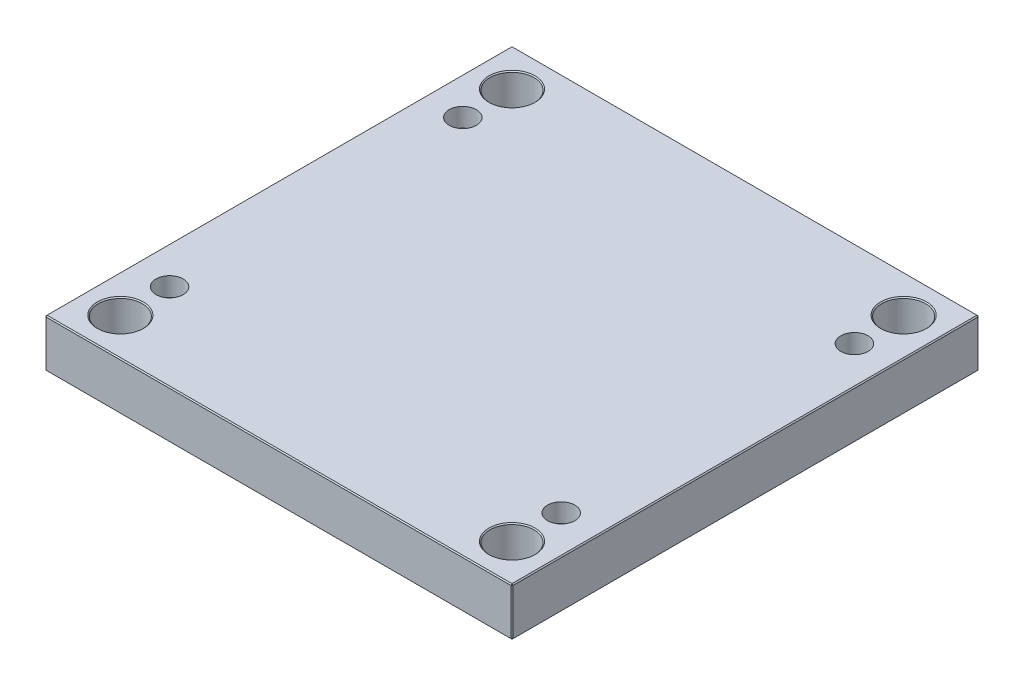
ISO-10303-21;
HEADER;
FILE_DESCRIPTION(('STEP AP214'),'2;1');
FILE_NAME('part.step','',(''),(''),'','','');
FILE_SCHEMA(('AUTOMOTIVE_DESIGN { 1 0 10303 214 1 1 1 1 }'));
ENDSEC;
DATA;
#1=APPLICATION_CONTEXT('core data for automotive mechanical design processes');
#2=APPLICATION_PROTOCOL_DEFINITION('international standard','automotive_design',2000,#1);
#3=PRODUCT_CONTEXT('',#1,'mechanical');
#4=PRODUCT('Part','Part','',(#3));
#5=PRODUCT_RELATED_PRODUCT_CATEGORY('part','',(#4));
#6=PRODUCT_DEFINITION_FORMATION('','',#4);
#7=PRODUCT_DEFINITION_CONTEXT('part definition',#1,'design');
#8=PRODUCT_DEFINITION('design','',#6,#7);
#9=PRODUCT_DEFINITION_SHAPE('','',#8);
#10=(LENGTH_UNIT() NAMED_UNIT(*) SI_UNIT(.MILLI.,.METRE.));
#11=(NAMED_UNIT(*) PLANE_ANGLE_UNIT() SI_UNIT($,.RADIAN.));
#12=(NAMED_UNIT(*) SI_UNIT($,.STERADIAN.) SOLID_ANGLE_UNIT());
#13=UNCERTAINTY_MEASURE_WITH_UNIT(LENGTH_MEASURE(1.E-05),#10,'distance_accuracy_value','');
#14=(GEOMETRIC_REPRESENTATION_CONTEXT(3) GLOBAL_UNCERTAINTY_ASSIGNED_CONTEXT((#13)) GLOBAL_UNIT_ASSIGNED_CONTEXT((#10,
#11,#12)) REPRESENTATION_CONTEXT('',''));
#15=CARTESIAN_POINT('',(0.,0.,0.));
#16=DIRECTION('',(0.,0.,1.));
#17=DIRECTION('',(1.,0.,0.));
#18=AXIS2_PLACEMENT_3D('',#15,#16,#17);
#19=CARTESIAN_POINT('',(-187.,0.,-140.));
#20=DIRECTION('',(0.,1.,0.));
#21=DIRECTION('',(0.,0.,1.));
#22=AXIS2_PLACEMENT_3D('',#19,#20,#21);
#23=CYLINDRICAL_SURFACE('',#22,8.);
#24=CARTESIAN_POINT('',(-187.,0.,-140.));
#25=DIRECTION('',(0.,1.,0.));
#26=DIRECTION('',(0.,0.,1.));
#27=AXIS2_PLACEMENT_3D('',#24,#25,#26);
#28=CIRCLE('',#27,8.);
#29=CARTESIAN_POINT('',(-187.,0.,-132.));
#30=VERTEX_POINT('',#29);
#31=EDGE_CURVE('E150',#30,#30,#28,.T.);
#32=ORIENTED_EDGE('',*,*,#31,.F.);
#33=EDGE_LOOP('',(#32));
#34=FACE_BOUND('',#33,.T.);
#35=CARTESIAN_POINT('',(-187.,28.,-140.));
#36=DIRECTION('',(0.,1.,0.));
#37=DIRECTION('',(0.,0.,1.));
#38=AXIS2_PLACEMENT_3D('',#35,#36,#37);
#39=CIRCLE('',#38,8.);
#40=CARTESIAN_POINT('',(-187.,28.,-132.));
#41=VERTEX_POINT('',#40);
#42=EDGE_CURVE('E20',#41,#41,#39,.F.);
#43=ORIENTED_EDGE('',*,*,#42,.F.);
#44=EDGE_LOOP('',(#43));
#45=FACE_BOUND('',#44,.T.);
#46=ADVANCED_FACE('F16',(#34,#45),#23,.F.);
#47=CARTESIAN_POINT('',(187.,0.,-140.));
#48=DIRECTION('',(0.,1.,0.));
#49=DIRECTION('',(0.,0.,1.));
#50=AXIS2_PLACEMENT_3D('',#47,#48,#49);
#51=CYLINDRICAL_SURFACE('',#50,8.);
#52=CARTESIAN_POINT('',(187.,0.,-140.));
#53=DIRECTION('',(0.,1.,0.));
#54=DIRECTION('',(0.,0.,1.));
#55=AXIS2_PLACEMENT_3D('',#52,#53,#54);
#56=CIRCLE('',#55,8.);
#57=CARTESIAN_POINT('',(187.,0.,-132.));
#58=VERTEX_POINT('',#57);
#59=EDGE_CURVE('E307',#58,#58,#56,.T.);
#60=ORIENTED_EDGE('',*,*,#59,.F.);
#61=EDGE_LOOP('',(#60));
#62=FACE_BOUND('',#61,.T.);
#63=CARTESIAN_POINT('',(187.,28.,-140.));
#64=DIRECTION('',(0.,1.,0.));
#65=DIRECTION('',(0.,0.,1.));
#66=AXIS2_PLACEMENT_3D('',#63,#64,#65);
#67=CIRCLE('',#66,8.);
#68=CARTESIAN_POINT('',(187.,28.,-132.));
#69=VERTEX_POINT('',#68);
#70=EDGE_CURVE('E294',#69,#69,#67,.F.);
#71=ORIENTED_EDGE('',*,*,#70,.F.);
#72=EDGE_LOOP('',(#71));
#73=FACE_BOUND('',#72,.T.);
#74=ADVANCED_FACE('F473',(#62,#73),#51,.F.);
#75=CARTESIAN_POINT('',(187.,0.,140.));
#76=DIRECTION('',(0.,1.,0.));
#77=DIRECTION('',(0.,0.,1.));
#78=AXIS2_PLACEMENT_3D('',#75,#76,#77);
#79=CYLINDRICAL_SURFACE('',#78,8.);
#80=CARTESIAN_POINT('',(187.,0.,140.));
#81=DIRECTION('',(0.,1.,0.));
#82=DIRECTION('',(0.,0.,1.));
#83=AXIS2_PLACEMENT_3D('',#80,#81,#82);
#84=CIRCLE('',#83,8.);
#85=CARTESIAN_POINT('',(187.,0.,148.));
#86=VERTEX_POINT('',#85);
#87=EDGE_CURVE('E303',#86,#86,#84,.T.);
#88=ORIENTED_EDGE('',*,*,#87,.F.);
#89=EDGE_LOOP('',(#88));
#90=FACE_BOUND('',#89,.T.);
#91=CARTESIAN_POINT('',(187.,28.,140.));
#92=DIRECTION('',(0.,1.,0.));
#93=DIRECTION('',(0.,0.,1.));
#94=AXIS2_PLACEMENT_3D('',#91,#92,#93);
#95=CIRCLE('',#94,8.);
#96=CARTESIAN_POINT('',(187.,28.,148.));
#97=VERTEX_POINT('',#96);
#98=EDGE_CURVE('E291',#97,#97,#95,.F.);
#99=ORIENTED_EDGE('',*,*,#98,.F.);
#100=EDGE_LOOP('',(#99));
#101=FACE_BOUND('',#100,.T.);
#102=ADVANCED_FACE('F480',(#90,#101),#79,.F.);
#103=CARTESIAN_POINT('',(-187.,0.,140.));
#104=DIRECTION('',(0.,1.,0.));
#105=DIRECTION('',(0.,0.,1.));
#106=AXIS2_PLACEMENT_3D('',#103,#104,#105);
#107=CYLINDRICAL_SURFACE('',#106,8.);
#108=CARTESIAN_POINT('',(-187.,0.,140.));
#109=DIRECTION('',(0.,1.,0.));
#110=DIRECTION('',(0.,0.,1.));
#111=AXIS2_PLACEMENT_3D('',#108,#109,#110);
#112=CIRCLE('',#111,8.);
#113=CARTESIAN_POINT('',(-187.,0.,148.));
#114=VERTEX_POINT('',#113);
#115=EDGE_CURVE('E299',#114,#114,#112,.T.);
#116=ORIENTED_EDGE('',*,*,#115,.F.);
#117=EDGE_LOOP('',(#116));
#118=FACE_BOUND('',#117,.T.);
#119=CARTESIAN_POINT('',(-187.,28.,140.));
#120=DIRECTION('',(0.,1.,0.));
#121=DIRECTION('',(0.,0.,1.));
#122=AXIS2_PLACEMENT_3D('',#119,#120,#121);
#123=CIRCLE('',#122,8.);
#124=CARTESIAN_POINT('',(-187.,28.,148.));
#125=VERTEX_POINT('',#124);
#126=EDGE_CURVE('E288',#125,#125,#123,.F.);
#127=ORIENTED_EDGE('',*,*,#126,.F.);
#128=EDGE_LOOP('',(#127));
#129=FACE_BOUND('',#128,.T.);
#130=ADVANCED_FACE('F485',(#118,#129),#107,.F.);
#131=CARTESIAN_POINT('',(-223.,46.,223.));
#132=DIRECTION('',(1.,0.,0.));
#133=DIRECTION('',(0.,0.,-1.));
#134=AXIS2_PLACEMENT_3D('',#131,#132,#133);
#135=PLANE('',#134);
#136=DIRECTION('',(0.,-1.,0.));
#137=VECTOR('',#136,1.);
#138=CARTESIAN_POINT('',(-223.,46.,-222.));
#139=LINE('',#138,#137);
#140=CARTESIAN_POINT('',(-223.,45.,-222.));
#141=VERTEX_POINT('',#140);
#142=CARTESIAN_POINT('',(-223.,1.,-222.));
#143=VERTEX_POINT('',#142);
#144=EDGE_CURVE('E118',#141,#143,#139,.T.);
#145=ORIENTED_EDGE('',*,*,#144,.T.);
#146=DIRECTION('',(0.,0.,1.));
#147=VECTOR('',#146,1.);
#148=CARTESIAN_POINT('',(-223.,1.,223.));
#149=LINE('',#148,#147);
#150=CARTESIAN_POINT('',(-223.,1.,222.));
#151=VERTEX_POINT('',#150);
#152=EDGE_CURVE('E114',#143,#151,#149,.T.);
#153=ORIENTED_EDGE('',*,*,#152,.T.);
#154=DIRECTION('',(0.,1.,0.));
#155=VECTOR('',#154,1.);
#156=CARTESIAN_POINT('',(-223.,46.,222.));
#157=LINE('',#156,#155);
#158=CARTESIAN_POINT('',(-223.,45.,222.));
#159=VERTEX_POINT('',#158);
#160=EDGE_CURVE('E106',#151,#159,#157,.T.);
#161=ORIENTED_EDGE('',*,*,#160,.T.);
#162=DIRECTION('',(0.,0.,-1.));
#163=VECTOR('',#162,1.);
#164=CARTESIAN_POINT('',(-223.,45.,-223.));
#165=LINE('',#164,#163);
#166=EDGE_CURVE('E111',#159,#141,#165,.T.);
#167=ORIENTED_EDGE('',*,*,#166,.T.);
#168=EDGE_LOOP('',(#145,#153,#161,#167));
#169=FACE_BOUND('',#168,.T.);
#170=ADVANCED_FACE('F109',(#169),#135,.F.);
#171=CARTESIAN_POINT('',(223.,46.,223.));
#172=DIRECTION('',(0.,0.,-1.));
#173=DIRECTION('',(-1.,0.,0.));
#174=AXIS2_PLACEMENT_3D('',#171,#172,#173);
#175=PLANE('',#174);
#176=DIRECTION('',(-1.,0.,0.));
#177=VECTOR('',#176,1.);
#178=CARTESIAN_POINT('',(-223.,45.,223.));
#179=LINE('',#178,#177);
#180=CARTESIAN_POINT('',(222.,45.,223.));
#181=VERTEX_POINT('',#180);
#182=CARTESIAN_POINT('',(-222.,45.,223.));
#183=VERTEX_POINT('',#182);
#184=EDGE_CURVE('E173',#181,#183,#179,.T.);
#185=ORIENTED_EDGE('',*,*,#184,.T.);
#186=DIRECTION('',(0.,-1.,0.));
#187=VECTOR('',#186,1.);
#188=CARTESIAN_POINT('',(-222.,46.,223.));
#189=LINE('',#188,#187);
#190=CARTESIAN_POINT('',(-222.,1.,223.));
#191=VERTEX_POINT('',#190);
#192=EDGE_CURVE('E126',#183,#191,#189,.T.);
#193=ORIENTED_EDGE('',*,*,#192,.T.);
#194=DIRECTION('',(1.,0.,0.));
#195=VECTOR('',#194,1.);
#196=CARTESIAN_POINT('',(223.,1.,223.));
#197=LINE('',#196,#195);
#198=CARTESIAN_POINT('',(222.,1.,223.));
#199=VERTEX_POINT('',#198);
#200=EDGE_CURVE('E177',#191,#199,#197,.T.);
#201=ORIENTED_EDGE('',*,*,#200,.T.);
#202=DIRECTION('',(0.,1.,0.));
#203=VECTOR('',#202,1.);
#204=CARTESIAN_POINT('',(222.,46.,223.));
#205=LINE('',#204,#203);
#206=EDGE_CURVE('E175',#199,#181,#205,.T.);
#207=ORIENTED_EDGE('',*,*,#206,.T.);
#208=EDGE_LOOP('',(#185,#193,#201,#207));
#209=FACE_BOUND('',#208,.T.);
#210=ADVANCED_FACE('F438',(#209),#175,.F.);
#211=CARTESIAN_POINT('',(223.,46.,223.));
#212=DIRECTION('',(-1.,0.,0.));
#213=DIRECTION('',(0.,0.,1.));
#214=AXIS2_PLACEMENT_3D('',#211,#212,#213);
#215=PLANE('',#214);
#216=DIRECTION('',(0.,0.,-1.));
#217=VECTOR('',#216,1.);
#218=CARTESIAN_POINT('',(223.,1.,223.));
#219=LINE('',#218,#217);
#220=CARTESIAN_POINT('',(223.,1.,222.));
#221=VERTEX_POINT('',#220);
#222=CARTESIAN_POINT('',(223.,1.,-222.));
#223=VERTEX_POINT('',#222);
#224=EDGE_CURVE('E168',#221,#223,#219,.T.);
#225=ORIENTED_EDGE('',*,*,#224,.T.);
#226=DIRECTION('',(0.,1.,0.));
#227=VECTOR('',#226,1.);
#228=CARTESIAN_POINT('',(223.,46.,-222.));
#229=LINE('',#228,#227);
#230=CARTESIAN_POINT('',(223.,45.,-222.));
#231=VERTEX_POINT('',#230);
#232=EDGE_CURVE('E170',#223,#231,#229,.T.);
#233=ORIENTED_EDGE('',*,*,#232,.T.);
#234=DIRECTION('',(0.,0.,1.));
#235=VECTOR('',#234,1.);
#236=CARTESIAN_POINT('',(223.,45.,223.));
#237=LINE('',#236,#235);
#238=CARTESIAN_POINT('',(223.,45.,222.));
#239=VERTEX_POINT('',#238);
#240=EDGE_CURVE('E164',#231,#239,#237,.T.);
#241=ORIENTED_EDGE('',*,*,#240,.T.);
#242=DIRECTION('',(0.,-1.,0.));
#243=VECTOR('',#242,1.);
#244=CARTESIAN_POINT('',(223.,46.,222.));
#245=LINE('',#244,#243);
#246=EDGE_CURVE('E166',#239,#221,#245,.T.);
#247=ORIENTED_EDGE('',*,*,#246,.T.);
#248=EDGE_LOOP('',(#225,#233,#241,#247));
#249=FACE_BOUND('',#248,.T.);
#250=ADVANCED_FACE('F431',(#249),#215,.F.);
#251=CARTESIAN_POINT('',(223.,46.,-223.));
#252=DIRECTION('',(0.,0.,1.));
#253=DIRECTION('',(1.,0.,0.));
#254=AXIS2_PLACEMENT_3D('',#251,#252,#253);
#255=PLANE('',#254);
#256=DIRECTION('',(0.,-1.,0.));
#257=VECTOR('',#256,1.);
#258=CARTESIAN_POINT('',(222.,46.,-223.));
#259=LINE('',#258,#257);
#260=CARTESIAN_POINT('',(222.,45.,-223.));
#261=VERTEX_POINT('',#260);
#262=CARTESIAN_POINT('',(222.,1.,-223.));
#263=VERTEX_POINT('',#262);
#264=EDGE_CURVE('E157',#261,#263,#259,.T.);
#265=ORIENTED_EDGE('',*,*,#264,.T.);
#266=DIRECTION('',(-1.,0.,0.));
#267=VECTOR('',#266,1.);
#268=CARTESIAN_POINT('',(223.,1.,-223.));
#269=LINE('',#268,#267);
#270=CARTESIAN_POINT('',(-222.,1.,-223.));
#271=VERTEX_POINT('',#270);
#272=EDGE_CURVE('E162',#263,#271,#269,.T.);
#273=ORIENTED_EDGE('',*,*,#272,.T.);
#274=DIRECTION('',(0.,1.,0.));
#275=VECTOR('',#274,1.);
#276=CARTESIAN_POINT('',(-222.,46.,-223.));
#277=LINE('',#276,#275);
#278=CARTESIAN_POINT('',(-222.,45.,-223.));
#279=VERTEX_POINT('',#278);
#280=EDGE_CURVE('E159',#271,#279,#277,.T.);
#281=ORIENTED_EDGE('',*,*,#280,.T.);
#282=DIRECTION('',(1.,0.,0.));
#283=VECTOR('',#282,1.);
#284=CARTESIAN_POINT('',(223.,45.,-223.));
#285=LINE('',#284,#283);
#286=EDGE_CURVE('E155',#279,#261,#285,.T.);
#287=ORIENTED_EDGE('',*,*,#286,.T.);
#288=EDGE_LOOP('',(#265,#273,#281,#287));
#289=FACE_BOUND('',#288,.T.);
#290=ADVANCED_FACE('F349',(#289),#255,.F.);
#291=CARTESIAN_POINT('',(0.,46.,0.));
#292=DIRECTION('',(0.,1.,0.));
#293=DIRECTION('',(0.,0.,1.));
#294=AXIS2_PLACEMENT_3D('',#291,#292,#293);
#295=PLANE('',#294);
#296=CARTESIAN_POINT('',(-187.,46.,140.));
#297=DIRECTION('',(0.,1.,0.));
#298=DIRECTION('',(0.,0.,1.));
#299=AXIS2_PLACEMENT_3D('',#296,#297,#298);
#300=CIRCLE('',#299,13.);
#301=CARTESIAN_POINT('',(-187.,46.,153.));
#302=VERTEX_POINT('',#301);
#303=EDGE_CURVE('E318',#302,#302,#300,.T.);
#304=ORIENTED_EDGE('',*,*,#303,.F.);
#305=EDGE_LOOP('',(#304));
#306=FACE_BOUND('',#305,.T.);
#307=CARTESIAN_POINT('',(187.,46.,140.));
#308=DIRECTION('',(0.,1.,0.));
#309=DIRECTION('',(0.,0.,1.));
#310=AXIS2_PLACEMENT_3D('',#307,#308,#309);
#311=CIRCLE('',#310,13.);
#312=CARTESIAN_POINT('',(187.,46.,153.));
#313=VERTEX_POINT('',#312);
#314=EDGE_CURVE('E324',#313,#313,#311,.T.);
#315=ORIENTED_EDGE('',*,*,#314,.F.);
#316=EDGE_LOOP('',(#315));
#317=FACE_BOUND('',#316,.T.);
#318=CARTESIAN_POINT('',(187.,46.,-140.));
#319=DIRECTION('',(0.,1.,0.));
#320=DIRECTION('',(0.,0.,1.));
#321=AXIS2_PLACEMENT_3D('',#318,#319,#320);
#322=CIRCLE('',#321,13.);
#323=CARTESIAN_POINT('',(187.,46.,-127.));
#324=VERTEX_POINT('',#323);
#325=EDGE_CURVE('E330',#324,#324,#322,.T.);
#326=ORIENTED_EDGE('',*,*,#325,.F.);
#327=EDGE_LOOP('',(#326));
#328=FACE_BOUND('',#327,.T.);
#329=CARTESIAN_POINT('',(-187.,46.,-140.));
#330=DIRECTION('',(0.,1.,0.));
#331=DIRECTION('',(0.,0.,1.));
#332=AXIS2_PLACEMENT_3D('',#329,#330,#331);
#333=CIRCLE('',#332,13.);
#334=CARTESIAN_POINT('',(-187.,46.,-127.));
#335=VERTEX_POINT('',#334);
#336=EDGE_CURVE('E312',#335,#335,#333,.T.);
#337=ORIENTED_EDGE('',*,*,#336,.F.);
#338=EDGE_LOOP('',(#337));
#339=FACE_BOUND('',#338,.T.);
#340=CARTESIAN_POINT('',(-187.,46.,187.));
#341=DIRECTION('',(0.,1.,0.));
#342=DIRECTION('',(0.,0.,1.));
#343=AXIS2_PLACEMENT_3D('',#340,#341,#342);
#344=CIRCLE('',#343,22.);
#345=CARTESIAN_POINT('',(-187.,46.,209.));
#346=VERTEX_POINT('',#345);
#347=EDGE_CURVE('E259',#346,#346,#344,.F.);
#348=ORIENTED_EDGE('',*,*,#347,.T.);
#349=EDGE_LOOP('',(#348));
#350=FACE_BOUND('',#349,.T.);
#351=CARTESIAN_POINT('',(187.,46.,187.));
#352=DIRECTION('',(0.,1.,0.));
#353=DIRECTION('',(0.,0.,1.));
#354=AXIS2_PLACEMENT_3D('',#351,#352,#353);
#355=CIRCLE('',#354,22.);
#356=CARTESIAN_POINT('',(187.,46.,209.));
#357=VERTEX_POINT('',#356);
#358=EDGE_CURVE('E256',#357,#357,#355,.F.);
#359=ORIENTED_EDGE('',*,*,#358,.T.);
#360=EDGE_LOOP('',(#359));
#361=FACE_BOUND('',#360,.T.);
#362=CARTESIAN_POINT('',(187.,46.,-187.));
#363=DIRECTION('',(0.,1.,0.));
#364=DIRECTION('',(0.,0.,1.));
#365=AXIS2_PLACEMENT_3D('',#362,#363,#364);
#366=CIRCLE('',#365,22.);
#367=CARTESIAN_POINT('',(187.,46.,-165.));
#368=VERTEX_POINT('',#367);
#369=EDGE_CURVE('E253',#368,#368,#366,.F.);
#370=ORIENTED_EDGE('',*,*,#369,.T.);
#371=EDGE_LOOP('',(#370));
#372=FACE_BOUND('',#371,.T.);
#373=CARTESIAN_POINT('',(-187.,46.,-187.));
#374=DIRECTION('',(0.,1.,0.));
#375=DIRECTION('',(0.,0.,1.));
#376=AXIS2_PLACEMENT_3D('',#373,#374,#375);
#377=CIRCLE('',#376,22.);
#378=CARTESIAN_POINT('',(-187.,46.,-165.));
#379=VERTEX_POINT('',#378);
#380=EDGE_CURVE('E250',#379,#379,#377,.F.);
#381=ORIENTED_EDGE('',*,*,#380,.T.);
#382=EDGE_LOOP('',(#381));
#383=FACE_BOUND('',#382,.T.);
#384=DIRECTION('',(0.,0.,-1.));
#385=VECTOR('',#384,1.);
#386=CARTESIAN_POINT('',(222.,46.,-223.));
#387=LINE('',#386,#385);
#388=CARTESIAN_POINT('',(222.,46.,222.));
#389=VERTEX_POINT('',#388);
#390=CARTESIAN_POINT('',(222.,46.,-222.));
#391=VERTEX_POINT('',#390);
#392=EDGE_CURVE('E33',#389,#391,#387,.T.);
#393=ORIENTED_EDGE('',*,*,#392,.T.);
#394=DIRECTION('',(-1.,0.,0.));
#395=VECTOR('',#394,1.);
#396=CARTESIAN_POINT('',(-223.,46.,-222.));
#397=LINE('',#396,#395);
#398=CARTESIAN_POINT('',(-222.,46.,-222.));
#399=VERTEX_POINT('',#398);
#400=EDGE_CURVE('E193',#391,#399,#397,.T.);
#401=ORIENTED_EDGE('',*,*,#400,.T.);
#402=DIRECTION('',(0.,0.,1.));
#403=VECTOR('',#402,1.);
#404=CARTESIAN_POINT('',(-222.,46.,223.));
#405=LINE('',#404,#403);
#406=CARTESIAN_POINT('',(-222.,46.,222.));
#407=VERTEX_POINT('',#406);
#408=EDGE_CURVE('E189',#399,#407,#405,.T.);
#409=ORIENTED_EDGE('',*,*,#408,.T.);
#410=DIRECTION('',(1.,0.,0.));
#411=VECTOR('',#410,1.);
#412=CARTESIAN_POINT('',(223.,46.,222.));
#413=LINE('',#412,#411);
#414=EDGE_CURVE('E38',#407,#389,#413,.T.);
#415=ORIENTED_EDGE('',*,*,#414,.T.);
#416=EDGE_LOOP('',(#393,#401,#409,#415));
#417=FACE_BOUND('',#416,.T.);
#418=ADVANCED_FACE('F345',(#306,#317,#328,#339,#350,#361,#372,#383,#417),#295,.T.);
#419=CARTESIAN_POINT('',(0.,0.,0.));
#420=DIRECTION('',(0.,1.,0.));
#421=DIRECTION('',(0.,0.,1.));
#422=AXIS2_PLACEMENT_3D('',#419,#420,#421);
#423=PLANE('',#422);
#424=CARTESIAN_POINT('',(-187.,0.,187.));
#425=DIRECTION('',(0.,1.,0.));
#426=DIRECTION('',(0.,0.,1.));
#427=AXIS2_PLACEMENT_3D('',#424,#425,#426);
#428=CIRCLE('',#427,22.);
#429=CARTESIAN_POINT('',(-187.,0.,209.));
#430=VERTEX_POINT('',#429);
#431=EDGE_CURVE('E271',#430,#430,#428,.T.);
#432=ORIENTED_EDGE('',*,*,#431,.T.);
#433=EDGE_LOOP('',(#432));
#434=FACE_BOUND('',#433,.T.);
#435=CARTESIAN_POINT('',(187.,0.,187.));
#436=DIRECTION('',(0.,1.,0.));
#437=DIRECTION('',(0.,0.,1.));
#438=AXIS2_PLACEMENT_3D('',#435,#436,#437);
#439=CIRCLE('',#438,22.);
#440=CARTESIAN_POINT('',(187.,0.,209.));
#441=VERTEX_POINT('',#440);
#442=EDGE_CURVE('E268',#441,#441,#439,.T.);
#443=ORIENTED_EDGE('',*,*,#442,.T.);
#444=EDGE_LOOP('',(#443));
#445=FACE_BOUND('',#444,.T.);
#446=CARTESIAN_POINT('',(187.,0.,-187.));
#447=DIRECTION('',(0.,1.,0.));
#448=DIRECTION('',(0.,0.,1.));
#449=AXIS2_PLACEMENT_3D('',#446,#447,#448);
#450=CIRCLE('',#449,22.);
#451=CARTESIAN_POINT('',(187.,0.,-165.));
#452=VERTEX_POINT('',#451);
#453=EDGE_CURVE('E265',#452,#452,#450,.T.);
#454=ORIENTED_EDGE('',*,*,#453,.T.);
#455=EDGE_LOOP('',(#454));
#456=FACE_BOUND('',#455,.T.);
#457=CARTESIAN_POINT('',(-187.,0.,-187.));
#458=DIRECTION('',(0.,1.,0.));
#459=DIRECTION('',(0.,0.,1.));
#460=AXIS2_PLACEMENT_3D('',#457,#458,#459);
#461=CIRCLE('',#460,22.);
#462=CARTESIAN_POINT('',(-187.,0.,-165.));
#463=VERTEX_POINT('',#462);
#464=EDGE_CURVE('E262',#463,#463,#461,.T.);
#465=ORIENTED_EDGE('',*,*,#464,.T.);
#466=EDGE_LOOP('',(#465));
#467=FACE_BOUND('',#466,.T.);
#468=ORIENTED_EDGE('',*,*,#115,.T.);
#469=EDGE_LOOP('',(#468));
#470=FACE_BOUND('',#469,.T.);
#471=ORIENTED_EDGE('',*,*,#87,.T.);
#472=EDGE_LOOP('',(#471));
#473=FACE_BOUND('',#472,.T.);
#474=ORIENTED_EDGE('',*,*,#59,.T.);
#475=EDGE_LOOP('',(#474));
#476=FACE_BOUND('',#475,.T.);
#477=ORIENTED_EDGE('',*,*,#31,.T.);
#478=EDGE_LOOP('',(#477));
#479=FACE_BOUND('',#478,.T.);
#480=DIRECTION('',(0.,0.,1.));
#481=VECTOR('',#480,1.);
#482=CARTESIAN_POINT('',(222.,0.,0.));
#483=LINE('',#482,#481);
#484=CARTESIAN_POINT('',(222.,0.,-222.));
#485=VERTEX_POINT('',#484);
#486=CARTESIAN_POINT('',(222.,0.,222.));
#487=VERTEX_POINT('',#486);
#488=EDGE_CURVE('E180',#485,#487,#483,.T.);
#489=ORIENTED_EDGE('',*,*,#488,.T.);
#490=DIRECTION('',(-1.,0.,0.));
#491=VECTOR('',#490,1.);
#492=CARTESIAN_POINT('',(0.,0.,222.));
#493=LINE('',#492,#491);
#494=CARTESIAN_POINT('',(-222.,0.,222.));
#495=VERTEX_POINT('',#494);
#496=EDGE_CURVE('E186',#487,#495,#493,.T.);
#497=ORIENTED_EDGE('',*,*,#496,.T.);
#498=DIRECTION('',(0.,0.,-1.));
#499=VECTOR('',#498,1.);
#500=CARTESIAN_POINT('',(-222.,0.,0.));
#501=LINE('',#500,#499);
#502=CARTESIAN_POINT('',(-222.,0.,-222.));
#503=VERTEX_POINT('',#502);
#504=EDGE_CURVE('E184',#495,#503,#501,.T.);
#505=ORIENTED_EDGE('',*,*,#504,.T.);
#506=DIRECTION('',(1.,0.,0.));
#507=VECTOR('',#506,1.);
#508=CARTESIAN_POINT('',(0.,0.,-222.));
#509=LINE('',#508,#507);
#510=EDGE_CURVE('E182',#503,#485,#509,.T.);
#511=ORIENTED_EDGE('',*,*,#510,.T.);
#512=EDGE_LOOP('',(#489,#497,#505,#511));
#513=FACE_BOUND('',#512,.T.);
#514=ADVANCED_FACE('F348',(#434,#445,#456,#467,#470,#473,#476,#479,#513),#423,.F.);
#515=CARTESIAN_POINT('',(223.,46.,222.));
#516=DIRECTION('',(-0.707106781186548,0.,-0.707106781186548));
#517=DIRECTION('',(0.,-1.,0.));
#518=AXIS2_PLACEMENT_3D('',#515,#516,#517);
#519=PLANE('',#518);
#520=DIRECTION('',(-0.707106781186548,0.,0.707106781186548));
#521=VECTOR('',#520,1.);
#522=CARTESIAN_POINT('',(222.,45.,223.));
#523=LINE('',#522,#521);
#524=EDGE_CURVE('E144',#181,#239,#523,.F.);
#525=ORIENTED_EDGE('',*,*,#524,.F.);
#526=ORIENTED_EDGE('',*,*,#206,.F.);
#527=DIRECTION('',(0.707106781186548,0.,-0.707106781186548));
#528=VECTOR('',#527,1.);
#529=CARTESIAN_POINT('',(222.,1.,223.));
#530=LINE('',#529,#528);
#531=EDGE_CURVE('E147',#221,#199,#530,.F.);
#532=ORIENTED_EDGE('',*,*,#531,.F.);
#533=ORIENTED_EDGE('',*,*,#246,.F.);
#534=EDGE_LOOP('',(#525,#526,#532,#533));
#535=FACE_BOUND('',#534,.T.);
#536=ADVANCED_FACE('F382',(#535),#519,.F.);
#537=CARTESIAN_POINT('',(222.,45.,223.));
#538=DIRECTION('',(0.577350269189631,0.577350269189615,0.577350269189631));
#539=DIRECTION('',(0.707106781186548,0.,-0.707106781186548));
#540=AXIS2_PLACEMENT_3D('',#537,#538,#539);
#541=PLANE('',#540);
#542=DIRECTION('',(0.,-0.707106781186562,0.707106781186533));
#543=VECTOR('',#542,1.);
#544=CARTESIAN_POINT('',(222.,45.,223.));
#545=LINE('',#544,#543);
#546=EDGE_CURVE('E238',#181,#389,#545,.F.);
#547=ORIENTED_EDGE('',*,*,#546,.F.);
#548=ORIENTED_EDGE('',*,*,#524,.T.);
#549=DIRECTION('',(-0.707106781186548,0.707106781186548,0.));
#550=VECTOR('',#549,1.);
#551=CARTESIAN_POINT('',(222.5,45.5,222.));
#552=LINE('',#551,#550);
#553=EDGE_CURVE('E240',#389,#239,#552,.F.);
#554=ORIENTED_EDGE('',*,*,#553,.F.);
#555=EDGE_LOOP('',(#547,#548,#554));
#556=FACE_BOUND('',#555,.T.);
#557=ADVANCED_FACE('F444',(#556),#541,.T.);
#558=CARTESIAN_POINT('',(222.,1.,223.));
#559=DIRECTION('',(0.577350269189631,-0.577350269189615,0.577350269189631));
#560=DIRECTION('',(0.707106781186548,0.,-0.707106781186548));
#561=AXIS2_PLACEMENT_3D('',#558,#559,#560);
#562=PLANE('',#561);
#563=DIRECTION('',(-0.707106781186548,-0.707106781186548,0.));
#564=VECTOR('',#563,1.);
#565=CARTESIAN_POINT('',(222.5,0.499999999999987,222.));
#566=LINE('',#565,#564);
#567=EDGE_CURVE('E232',#221,#487,#566,.T.);
#568=ORIENTED_EDGE('',*,*,#567,.F.);
#569=ORIENTED_EDGE('',*,*,#531,.T.);
#570=DIRECTION('',(0.,0.707106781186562,0.707106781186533));
#571=VECTOR('',#570,1.);
#572=CARTESIAN_POINT('',(222.,1.,223.));
#573=LINE('',#572,#571);
#574=EDGE_CURVE('E235',#487,#199,#573,.T.);
#575=ORIENTED_EDGE('',*,*,#574,.F.);
#576=EDGE_LOOP('',(#568,#569,#575));
#577=FACE_BOUND('',#576,.T.);
#578=ADVANCED_FACE('F403',(#577),#562,.T.);
#579=CARTESIAN_POINT('',(222.,46.,0.));
#580=DIRECTION('',(0.707106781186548,0.707106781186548,0.));
#581=DIRECTION('',(0.,0.,1.));
#582=AXIS2_PLACEMENT_3D('',#579,#580,#581);
#583=PLANE('',#582);
#584=ORIENTED_EDGE('',*,*,#553,.T.);
#585=ORIENTED_EDGE('',*,*,#240,.F.);
#586=DIRECTION('',(0.707106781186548,-0.707106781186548,0.));
#587=VECTOR('',#586,1.);
#588=CARTESIAN_POINT('',(223.,45.,-222.));
#589=LINE('',#588,#587);
#590=EDGE_CURVE('E227',#391,#231,#589,.T.);
#591=ORIENTED_EDGE('',*,*,#590,.F.);
#592=ORIENTED_EDGE('',*,*,#392,.F.);
#593=EDGE_LOOP('',(#584,#585,#591,#592));
#594=FACE_BOUND('',#593,.T.);
#595=ADVANCED_FACE('F446',(#594),#583,.T.);
#596=CARTESIAN_POINT('',(0.,46.,222.));
#597=DIRECTION('',(0.,0.707106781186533,0.707106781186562));
#598=DIRECTION('',(-1.,0.,0.));
#599=AXIS2_PLACEMENT_3D('',#596,#597,#598);
#600=PLANE('',#599);
#601=ORIENTED_EDGE('',*,*,#546,.T.);
#602=ORIENTED_EDGE('',*,*,#414,.F.);
#603=DIRECTION('',(0.,0.707106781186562,-0.707106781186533));
#604=VECTOR('',#603,1.);
#605=CARTESIAN_POINT('',(-222.,45.5,222.5));
#606=LINE('',#605,#604);
#607=EDGE_CURVE('E130',#183,#407,#606,.T.);
#608=ORIENTED_EDGE('',*,*,#607,.F.);
#609=ORIENTED_EDGE('',*,*,#184,.F.);
#610=EDGE_LOOP('',(#601,#602,#608,#609));
#611=FACE_BOUND('',#610,.T.);
#612=ADVANCED_FACE('F441',(#611),#600,.T.);
#613=CARTESIAN_POINT('',(-222.,46.,223.));
#614=DIRECTION('',(0.707106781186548,0.,-0.707106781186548));
#615=DIRECTION('',(0.,-1.,0.));
#616=AXIS2_PLACEMENT_3D('',#613,#614,#615);
#617=PLANE('',#616);
#618=DIRECTION('',(0.707106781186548,0.,0.707106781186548));
#619=VECTOR('',#618,1.);
#620=CARTESIAN_POINT('',(-222.,1.,223.));
#621=LINE('',#620,#619);
#622=EDGE_CURVE('E131',#191,#151,#621,.F.);
#623=ORIENTED_EDGE('',*,*,#622,.F.);
#624=ORIENTED_EDGE('',*,*,#192,.F.);
#625=DIRECTION('',(-0.707106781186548,0.,-0.707106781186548));
#626=VECTOR('',#625,1.);
#627=CARTESIAN_POINT('',(-223.,45.,222.));
#628=LINE('',#627,#626);
#629=EDGE_CURVE('E122',#159,#183,#628,.F.);
#630=ORIENTED_EDGE('',*,*,#629,.F.);
#631=ORIENTED_EDGE('',*,*,#160,.F.);
#632=EDGE_LOOP('',(#623,#624,#630,#631));
#633=FACE_BOUND('',#632,.T.);
#634=ADVANCED_FACE('F124',(#633),#617,.F.);
#635=CARTESIAN_POINT('',(223.,1.,223.));
#636=DIRECTION('',(0.,0.707106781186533,-0.707106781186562));
#637=DIRECTION('',(1.,0.,0.));
#638=AXIS2_PLACEMENT_3D('',#635,#636,#637);
#639=PLANE('',#638);
#640=ORIENTED_EDGE('',*,*,#574,.T.);
#641=ORIENTED_EDGE('',*,*,#200,.F.);
#642=DIRECTION('',(0.,-0.707106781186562,-0.707106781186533));
#643=VECTOR('',#642,1.);
#644=CARTESIAN_POINT('',(-222.,1.,223.));
#645=LINE('',#644,#643);
#646=EDGE_CURVE('E223',#495,#191,#645,.F.);
#647=ORIENTED_EDGE('',*,*,#646,.F.);
#648=ORIENTED_EDGE('',*,*,#496,.F.);
#649=EDGE_LOOP('',(#640,#641,#647,#648));
#650=FACE_BOUND('',#649,.T.);
#651=ADVANCED_FACE('F408',(#650),#639,.F.);
#652=CARTESIAN_POINT('',(223.,1.,223.));
#653=DIRECTION('',(-0.707106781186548,0.707106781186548,0.));
#654=DIRECTION('',(0.,0.,-1.));
#655=AXIS2_PLACEMENT_3D('',#652,#653,#654);
#656=PLANE('',#655);
#657=ORIENTED_EDGE('',*,*,#567,.T.);
#658=ORIENTED_EDGE('',*,*,#488,.F.);
#659=DIRECTION('',(0.707106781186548,0.707106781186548,0.));
#660=VECTOR('',#659,1.);
#661=CARTESIAN_POINT('',(222.5,0.499999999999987,-222.));
#662=LINE('',#661,#660);
#663=EDGE_CURVE('E220',#223,#485,#662,.F.);
#664=ORIENTED_EDGE('',*,*,#663,.F.);
#665=ORIENTED_EDGE('',*,*,#224,.F.);
#666=EDGE_LOOP('',(#657,#658,#664,#665));
#667=FACE_BOUND('',#666,.T.);
#668=ADVANCED_FACE('F401',(#667),#656,.F.);
#669=CARTESIAN_POINT('',(222.,46.,-223.));
#670=DIRECTION('',(-0.707106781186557,0.,0.707106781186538));
#671=DIRECTION('',(0.,-1.,0.));
#672=AXIS2_PLACEMENT_3D('',#669,#670,#671);
#673=PLANE('',#672);
#674=DIRECTION('',(0.707106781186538,0.,0.707106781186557));
#675=VECTOR('',#674,1.);
#676=CARTESIAN_POINT('',(223.,45.,-222.));
#677=LINE('',#676,#675);
#678=EDGE_CURVE('E229',#231,#261,#677,.F.);
#679=ORIENTED_EDGE('',*,*,#678,.F.);
#680=ORIENTED_EDGE('',*,*,#232,.F.);
#681=DIRECTION('',(-0.707106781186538,0.,-0.707106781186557));
#682=VECTOR('',#681,1.);
#683=CARTESIAN_POINT('',(222.,1.,-223.));
#684=LINE('',#683,#682);
#685=EDGE_CURVE('E217',#263,#223,#684,.F.);
#686=ORIENTED_EDGE('',*,*,#685,.F.);
#687=ORIENTED_EDGE('',*,*,#264,.F.);
#688=EDGE_LOOP('',(#679,#680,#686,#687));
#689=FACE_BOUND('',#688,.T.);
#690=ADVANCED_FACE('F428',(#689),#673,.F.);
#691=CARTESIAN_POINT('',(223.,45.,-222.));
#692=DIRECTION('',(0.577350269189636,0.57735026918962,-0.57735026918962));
#693=DIRECTION('',(-0.707106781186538,0.,-0.707106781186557));
#694=AXIS2_PLACEMENT_3D('',#691,#692,#693);
#695=PLANE('',#694);
#696=ORIENTED_EDGE('',*,*,#590,.T.);
#697=ORIENTED_EDGE('',*,*,#678,.T.);
#698=DIRECTION('',(0.,0.707106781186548,0.707106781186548));
#699=VECTOR('',#698,1.);
#700=CARTESIAN_POINT('',(222.,45.5,-222.5));
#701=LINE('',#700,#699);
#702=EDGE_CURVE('E138',#391,#261,#701,.F.);
#703=ORIENTED_EDGE('',*,*,#702,.F.);
#704=EDGE_LOOP('',(#696,#697,#703));
#705=FACE_BOUND('',#704,.T.);
#706=ADVANCED_FACE('F450',(#705),#695,.T.);
#707=CARTESIAN_POINT('',(-223.,45.,222.));
#708=DIRECTION('',(-0.577350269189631,0.577350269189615,0.577350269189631));
#709=DIRECTION('',(0.707106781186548,0.,0.707106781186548));
#710=AXIS2_PLACEMENT_3D('',#707,#708,#709);
#711=PLANE('',#710);
#712=ORIENTED_EDGE('',*,*,#629,.T.);
#713=ORIENTED_EDGE('',*,*,#607,.T.);
#714=DIRECTION('',(-0.707106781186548,-0.707106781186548,0.));
#715=VECTOR('',#714,1.);
#716=CARTESIAN_POINT('',(-223.,45.,222.));
#717=LINE('',#716,#715);
#718=EDGE_CURVE('E134',#159,#407,#717,.F.);
#719=ORIENTED_EDGE('',*,*,#718,.F.);
#720=EDGE_LOOP('',(#712,#713,#719));
#721=FACE_BOUND('',#720,.T.);
#722=ADVANCED_FACE('F135',(#721),#711,.T.);
#723=CARTESIAN_POINT('',(-222.,1.,223.));
#724=DIRECTION('',(-0.577350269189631,-0.577350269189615,0.577350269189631));
#725=DIRECTION('',(0.707106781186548,0.,0.707106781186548));
#726=AXIS2_PLACEMENT_3D('',#723,#724,#725);
#727=PLANE('',#726);
#728=ORIENTED_EDGE('',*,*,#646,.T.);
#729=ORIENTED_EDGE('',*,*,#622,.T.);
#730=DIRECTION('',(-0.707106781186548,0.707106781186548,0.));
#731=VECTOR('',#730,1.);
#732=CARTESIAN_POINT('',(-222.5,0.499999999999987,222.));
#733=LINE('',#732,#731);
#734=EDGE_CURVE('E139',#495,#151,#733,.T.);
#735=ORIENTED_EDGE('',*,*,#734,.F.);
#736=EDGE_LOOP('',(#728,#729,#735));
#737=FACE_BOUND('',#736,.T.);
#738=ADVANCED_FACE('F411',(#737),#727,.T.);
#739=CARTESIAN_POINT('',(222.,1.,-223.));
#740=DIRECTION('',(0.577350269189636,-0.57735026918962,-0.57735026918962));
#741=DIRECTION('',(-0.707106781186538,0.,-0.707106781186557));
#742=AXIS2_PLACEMENT_3D('',#739,#740,#741);
#743=PLANE('',#742);
#744=ORIENTED_EDGE('',*,*,#685,.T.);
#745=ORIENTED_EDGE('',*,*,#663,.T.);
#746=DIRECTION('',(0.,-0.707106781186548,0.707106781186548));
#747=VECTOR('',#746,1.);
#748=CARTESIAN_POINT('',(222.,1.,-223.));
#749=LINE('',#748,#747);
#750=EDGE_CURVE('E210',#263,#485,#749,.T.);
#751=ORIENTED_EDGE('',*,*,#750,.F.);
#752=EDGE_LOOP('',(#744,#745,#751));
#753=FACE_BOUND('',#752,.T.);
#754=ADVANCED_FACE('F422',(#753),#743,.T.);
#755=CARTESIAN_POINT('',(0.,46.,-222.));
#756=DIRECTION('',(0.,0.707106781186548,-0.707106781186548));
#757=DIRECTION('',(1.,0.,0.));
#758=AXIS2_PLACEMENT_3D('',#755,#756,#757);
#759=PLANE('',#758);
#760=ORIENTED_EDGE('',*,*,#702,.T.);
#761=ORIENTED_EDGE('',*,*,#286,.F.);
#762=DIRECTION('',(0.,-0.707106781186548,-0.707106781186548));
#763=VECTOR('',#762,1.);
#764=CARTESIAN_POINT('',(-222.,45.,-223.));
#765=LINE('',#764,#763);
#766=EDGE_CURVE('E207',#399,#279,#765,.T.);
#767=ORIENTED_EDGE('',*,*,#766,.F.);
#768=ORIENTED_EDGE('',*,*,#400,.F.);
#769=EDGE_LOOP('',(#760,#761,#767,#768));
#770=FACE_BOUND('',#769,.T.);
#771=ADVANCED_FACE('F454',(#770),#759,.T.);
#772=CARTESIAN_POINT('',(-222.,46.,0.));
#773=DIRECTION('',(-0.707106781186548,0.707106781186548,0.));
#774=DIRECTION('',(0.,0.,-1.));
#775=AXIS2_PLACEMENT_3D('',#772,#773,#774);
#776=PLANE('',#775);
#777=ORIENTED_EDGE('',*,*,#718,.T.);
#778=ORIENTED_EDGE('',*,*,#408,.F.);
#779=DIRECTION('',(0.707106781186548,0.707106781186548,0.));
#780=VECTOR('',#779,1.);
#781=CARTESIAN_POINT('',(-222.5,45.5,-222.));
#782=LINE('',#781,#780);
#783=EDGE_CURVE('E142',#141,#399,#782,.T.);
#784=ORIENTED_EDGE('',*,*,#783,.F.);
#785=ORIENTED_EDGE('',*,*,#166,.F.);
#786=EDGE_LOOP('',(#777,#778,#784,#785));
#787=FACE_BOUND('',#786,.T.);
#788=ADVANCED_FACE('F141',(#787),#776,.T.);
#789=CARTESIAN_POINT('',(-223.,1.,223.));
#790=DIRECTION('',(0.707106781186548,0.707106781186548,0.));
#791=DIRECTION('',(0.,0.,1.));
#792=AXIS2_PLACEMENT_3D('',#789,#790,#791);
#793=PLANE('',#792);
#794=ORIENTED_EDGE('',*,*,#734,.T.);
#795=ORIENTED_EDGE('',*,*,#152,.F.);
#796=DIRECTION('',(0.707106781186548,-0.707106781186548,0.));
#797=VECTOR('',#796,1.);
#798=CARTESIAN_POINT('',(-223.,1.,-222.));
#799=LINE('',#798,#797);
#800=EDGE_CURVE('E203',#503,#143,#799,.F.);
#801=ORIENTED_EDGE('',*,*,#800,.F.);
#802=ORIENTED_EDGE('',*,*,#504,.F.);
#803=EDGE_LOOP('',(#794,#795,#801,#802));
#804=FACE_BOUND('',#803,.T.);
#805=ADVANCED_FACE('F413',(#804),#793,.F.);
#806=CARTESIAN_POINT('',(223.,1.,-223.));
#807=DIRECTION('',(0.,0.707106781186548,0.707106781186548));
#808=DIRECTION('',(-1.,0.,0.));
#809=AXIS2_PLACEMENT_3D('',#806,#807,#808);
#810=PLANE('',#809);
#811=ORIENTED_EDGE('',*,*,#750,.T.);
#812=ORIENTED_EDGE('',*,*,#510,.F.);
#813=DIRECTION('',(0.,0.707106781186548,-0.707106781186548));
#814=VECTOR('',#813,1.);
#815=CARTESIAN_POINT('',(-222.,0.5,-222.5));
#816=LINE('',#815,#814);
#817=EDGE_CURVE('E200',#271,#503,#816,.F.);
#818=ORIENTED_EDGE('',*,*,#817,.F.);
#819=ORIENTED_EDGE('',*,*,#272,.F.);
#820=EDGE_LOOP('',(#811,#812,#818,#819));
#821=FACE_BOUND('',#820,.T.);
#822=ADVANCED_FACE('F417',(#821),#810,.F.);
#823=CARTESIAN_POINT('',(-222.,45.,-223.));
#824=DIRECTION('',(-0.577350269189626,0.577350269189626,-0.577350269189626));
#825=DIRECTION('',(-0.707106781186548,0.,0.707106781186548));
#826=AXIS2_PLACEMENT_3D('',#823,#824,#825);
#827=PLANE('',#826);
#828=ORIENTED_EDGE('',*,*,#783,.T.);
#829=ORIENTED_EDGE('',*,*,#766,.T.);
#830=DIRECTION('',(0.707106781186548,0.,-0.707106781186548));
#831=VECTOR('',#830,1.);
#832=CARTESIAN_POINT('',(-222.,45.,-223.));
#833=LINE('',#832,#831);
#834=EDGE_CURVE('E198',#141,#279,#833,.T.);
#835=ORIENTED_EDGE('',*,*,#834,.F.);
#836=EDGE_LOOP('',(#828,#829,#835));
#837=FACE_BOUND('',#836,.T.);
#838=ADVANCED_FACE('F456',(#837),#827,.T.);
#839=CARTESIAN_POINT('',(-223.,1.,-222.));
#840=DIRECTION('',(-0.577350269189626,-0.577350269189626,-0.577350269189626));
#841=DIRECTION('',(-0.707106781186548,0.,0.707106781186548));
#842=AXIS2_PLACEMENT_3D('',#839,#840,#841);
#843=PLANE('',#842);
#844=ORIENTED_EDGE('',*,*,#817,.T.);
#845=ORIENTED_EDGE('',*,*,#800,.T.);
#846=DIRECTION('',(-0.707106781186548,0.,0.707106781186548));
#847=VECTOR('',#846,1.);
#848=CARTESIAN_POINT('',(-223.,1.,-222.));
#849=LINE('',#848,#847);
#850=EDGE_CURVE('E196',#271,#143,#849,.T.);
#851=ORIENTED_EDGE('',*,*,#850,.F.);
#852=EDGE_LOOP('',(#844,#845,#851));
#853=FACE_BOUND('',#852,.T.);
#854=ADVANCED_FACE('F461',(#853),#843,.T.);
#855=CARTESIAN_POINT('',(-223.,46.,-222.));
#856=DIRECTION('',(0.707106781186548,0.,0.707106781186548));
#857=DIRECTION('',(0.,-1.,0.));
#858=AXIS2_PLACEMENT_3D('',#855,#856,#857);
#859=PLANE('',#858);
#860=ORIENTED_EDGE('',*,*,#834,.T.);
#861=ORIENTED_EDGE('',*,*,#280,.F.);
#862=ORIENTED_EDGE('',*,*,#850,.T.);
#863=ORIENTED_EDGE('',*,*,#144,.F.);
#864=EDGE_LOOP('',(#860,#861,#862,#863));
#865=FACE_BOUND('',#864,.T.);
#866=ADVANCED_FACE('F372',(#865),#859,.F.);
#867=CARTESIAN_POINT('',(-187.,0.,-187.));
#868=DIRECTION('',(0.,1.,0.));
#869=DIRECTION('',(0.,0.,1.));
#870=AXIS2_PLACEMENT_3D('',#867,#868,#869);
#871=CYLINDRICAL_SURFACE('',#870,21.);
#872=CARTESIAN_POINT('',(-187.,45.,-187.));
#873=DIRECTION('',(0.,1.,0.));
#874=DIRECTION('',(0.,0.,1.));
#875=AXIS2_PLACEMENT_3D('',#872,#873,#874);
#876=CIRCLE('',#875,21.);
#877=CARTESIAN_POINT('',(-187.,45.,-166.));
#878=VERTEX_POINT('',#877);
#879=EDGE_CURVE('E10',#878,#878,#876,.T.);
#880=ORIENTED_EDGE('',*,*,#879,.T.);
#881=EDGE_LOOP('',(#880));
#882=FACE_BOUND('',#881,.T.);
#883=CARTESIAN_POINT('',(-187.,0.999999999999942,-187.));
#884=DIRECTION('',(0.,1.,0.));
#885=DIRECTION('',(0.,0.,1.));
#886=AXIS2_PLACEMENT_3D('',#883,#884,#885);
#887=CIRCLE('',#886,21.);
#888=CARTESIAN_POINT('',(-187.,0.999999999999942,-166.));
#889=VERTEX_POINT('',#888);
#890=EDGE_CURVE('E25',#889,#889,#887,.F.);
#891=ORIENTED_EDGE('',*,*,#890,.T.);
#892=EDGE_LOOP('',(#891));
#893=FACE_BOUND('',#892,.T.);
#894=ADVANCED_FACE('F368',(#882,#893),#871,.F.);
#895=CARTESIAN_POINT('',(187.,0.,-187.));
#896=DIRECTION('',(0.,1.,0.));
#897=DIRECTION('',(0.,0.,1.));
#898=AXIS2_PLACEMENT_3D('',#895,#896,#897);
#899=CYLINDRICAL_SURFACE('',#898,21.);
#900=CARTESIAN_POINT('',(187.,45.,-187.));
#901=DIRECTION('',(0.,1.,0.));
#902=DIRECTION('',(0.,0.,1.));
#903=AXIS2_PLACEMENT_3D('',#900,#901,#902);
#904=CIRCLE('',#903,21.);
#905=CARTESIAN_POINT('',(187.,45.,-166.));
#906=VERTEX_POINT('',#905);
#907=EDGE_CURVE('E283',#906,#906,#904,.T.);
#908=ORIENTED_EDGE('',*,*,#907,.T.);
#909=EDGE_LOOP('',(#908));
#910=FACE_BOUND('',#909,.T.);
#911=CARTESIAN_POINT('',(187.,0.999999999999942,-187.));
#912=DIRECTION('',(0.,1.,0.));
#913=DIRECTION('',(0.,0.,1.));
#914=AXIS2_PLACEMENT_3D('',#911,#912,#913);
#915=CIRCLE('',#914,21.);
#916=CARTESIAN_POINT('',(187.,0.999999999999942,-166.));
#917=VERTEX_POINT('',#916);
#918=EDGE_CURVE('E280',#917,#917,#915,.F.);
#919=ORIENTED_EDGE('',*,*,#918,.T.);
#920=EDGE_LOOP('',(#919));
#921=FACE_BOUND('',#920,.T.);
#922=ADVANCED_FACE('F371',(#910,#921),#899,.F.);
#923=CARTESIAN_POINT('',(187.,0.,187.));
#924=DIRECTION('',(0.,1.,0.));
#925=DIRECTION('',(0.,0.,1.));
#926=AXIS2_PLACEMENT_3D('',#923,#924,#925);
#927=CYLINDRICAL_SURFACE('',#926,21.);
#928=CARTESIAN_POINT('',(187.,45.,187.));
#929=DIRECTION('',(0.,1.,0.));
#930=DIRECTION('',(0.,0.,1.));
#931=AXIS2_PLACEMENT_3D('',#928,#929,#930);
#932=CIRCLE('',#931,21.);
#933=CARTESIAN_POINT('',(187.,45.,208.));
#934=VERTEX_POINT('',#933);
#935=EDGE_CURVE('E277',#934,#934,#932,.T.);
#936=ORIENTED_EDGE('',*,*,#935,.T.);
#937=EDGE_LOOP('',(#936));
#938=FACE_BOUND('',#937,.T.);
#939=CARTESIAN_POINT('',(187.,1.00000000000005,187.));
#940=DIRECTION('',(0.,1.,0.));
#941=DIRECTION('',(0.,0.,1.));
#942=AXIS2_PLACEMENT_3D('',#939,#940,#941);
#943=CIRCLE('',#942,21.);
#944=CARTESIAN_POINT('',(187.,1.00000000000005,208.));
#945=VERTEX_POINT('',#944);
#946=EDGE_CURVE('E274',#945,#945,#943,.F.);
#947=ORIENTED_EDGE('',*,*,#946,.T.);
#948=EDGE_LOOP('',(#947));
#949=FACE_BOUND('',#948,.T.);
#950=ADVANCED_FACE('F533',(#938,#949),#927,.F.);
#951=CARTESIAN_POINT('',(-187.,0.,187.));
#952=DIRECTION('',(0.,1.,0.));
#953=DIRECTION('',(0.,0.,1.));
#954=AXIS2_PLACEMENT_3D('',#951,#952,#953);
#955=CYLINDRICAL_SURFACE('',#954,21.);
#956=CARTESIAN_POINT('',(-187.,45.,187.));
#957=DIRECTION('',(0.,1.,0.));
#958=DIRECTION('',(0.,0.,1.));
#959=AXIS2_PLACEMENT_3D('',#956,#957,#958);
#960=CIRCLE('',#959,21.);
#961=CARTESIAN_POINT('',(-187.,45.,208.));
#962=VERTEX_POINT('',#961);
#963=EDGE_CURVE('E247',#962,#962,#960,.T.);
#964=ORIENTED_EDGE('',*,*,#963,.T.);
#965=EDGE_LOOP('',(#964));
#966=FACE_BOUND('',#965,.T.);
#967=CARTESIAN_POINT('',(-187.,1.00000000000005,187.));
#968=DIRECTION('',(0.,1.,0.));
#969=DIRECTION('',(0.,0.,1.));
#970=AXIS2_PLACEMENT_3D('',#967,#968,#969);
#971=CIRCLE('',#970,21.);
#972=CARTESIAN_POINT('',(-187.,1.00000000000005,208.));
#973=VERTEX_POINT('',#972);
#974=EDGE_CURVE('E195',#973,#973,#971,.F.);
#975=ORIENTED_EDGE('',*,*,#974,.T.);
#976=EDGE_LOOP('',(#975));
#977=FACE_BOUND('',#976,.T.);
#978=ADVANCED_FACE('F537',(#966,#977),#955,.F.);
#979=CARTESIAN_POINT('',(-187.,45.,187.));
#980=DIRECTION('',(0.,1.,0.));
#981=DIRECTION('',(0.,0.,1.));
#982=AXIS2_PLACEMENT_3D('',#979,#980,#981);
#983=CONICAL_SURFACE('',#982,21.,0.785398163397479);
#984=ORIENTED_EDGE('',*,*,#347,.F.);
#985=EDGE_LOOP('',(#984));
#986=FACE_BOUND('',#985,.T.);
#987=ORIENTED_EDGE('',*,*,#963,.F.);
#988=EDGE_LOOP('',(#987));
#989=FACE_BOUND('',#988,.T.);
#990=ADVANCED_FACE('F540',(#986,#989),#983,.F.);
#991=CARTESIAN_POINT('',(-187.,0.,187.));
#992=DIRECTION('',(0.,-1.,0.));
#993=DIRECTION('',(0.,0.,-1.));
#994=AXIS2_PLACEMENT_3D('',#991,#992,#993);
#995=CONICAL_SURFACE('',#994,22.,0.785398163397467);
#996=ORIENTED_EDGE('',*,*,#974,.F.);
#997=EDGE_LOOP('',(#996));
#998=FACE_BOUND('',#997,.T.);
#999=ORIENTED_EDGE('',*,*,#431,.F.);
#1000=EDGE_LOOP('',(#999));
#1001=FACE_BOUND('',#1000,.T.);
#1002=ADVANCED_FACE('F546',(#998,#1001),#995,.F.);
#1003=CARTESIAN_POINT('',(187.,45.,187.));
#1004=DIRECTION('',(0.,1.,0.));
#1005=DIRECTION('',(0.,0.,1.));
#1006=AXIS2_PLACEMENT_3D('',#1003,#1004,#1005);
#1007=CONICAL_SURFACE('',#1006,21.,0.785398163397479);
#1008=ORIENTED_EDGE('',*,*,#358,.F.);
#1009=EDGE_LOOP('',(#1008));
#1010=FACE_BOUND('',#1009,.T.);
#1011=ORIENTED_EDGE('',*,*,#935,.F.);
#1012=EDGE_LOOP('',(#1011));
#1013=FACE_BOUND('',#1012,.T.);
#1014=ADVANCED_FACE('F555',(#1010,#1013),#1007,.F.);
#1015=CARTESIAN_POINT('',(187.,0.,187.));
#1016=DIRECTION('',(0.,-1.,0.));
#1017=DIRECTION('',(0.,0.,-1.));
#1018=AXIS2_PLACEMENT_3D('',#1015,#1016,#1017);
#1019=CONICAL_SURFACE('',#1018,22.,0.785398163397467);
#1020=ORIENTED_EDGE('',*,*,#946,.F.);
#1021=EDGE_LOOP('',(#1020));
#1022=FACE_BOUND('',#1021,.T.);
#1023=ORIENTED_EDGE('',*,*,#442,.F.);
#1024=EDGE_LOOP('',(#1023));
#1025=FACE_BOUND('',#1024,.T.);
#1026=ADVANCED_FACE('F571',(#1022,#1025),#1019,.F.);
#1027=CARTESIAN_POINT('',(187.,45.,-187.));
#1028=DIRECTION('',(0.,1.,0.));
#1029=DIRECTION('',(0.,0.,1.));
#1030=AXIS2_PLACEMENT_3D('',#1027,#1028,#1029);
#1031=CONICAL_SURFACE('',#1030,21.,0.785398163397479);
#1032=ORIENTED_EDGE('',*,*,#369,.F.);
#1033=EDGE_LOOP('',(#1032));
#1034=FACE_BOUND('',#1033,.T.);
#1035=ORIENTED_EDGE('',*,*,#907,.F.);
#1036=EDGE_LOOP('',(#1035));
#1037=FACE_BOUND('',#1036,.T.);
#1038=ADVANCED_FACE('F564',(#1034,#1037),#1031,.F.);
#1039=CARTESIAN_POINT('',(187.,0.,-187.));
#1040=DIRECTION('',(0.,-1.,0.));
#1041=DIRECTION('',(0.,0.,-1.));
#1042=AXIS2_PLACEMENT_3D('',#1039,#1040,#1041);
#1043=CONICAL_SURFACE('',#1042,22.,0.785398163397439);
#1044=ORIENTED_EDGE('',*,*,#918,.F.);
#1045=EDGE_LOOP('',(#1044));
#1046=FACE_BOUND('',#1045,.T.);
#1047=ORIENTED_EDGE('',*,*,#453,.F.);
#1048=EDGE_LOOP('',(#1047));
#1049=FACE_BOUND('',#1048,.T.);
#1050=ADVANCED_FACE('F365',(#1046,#1049),#1043,.F.);
#1051=CARTESIAN_POINT('',(-187.,45.,-187.));
#1052=DIRECTION('',(0.,1.,0.));
#1053=DIRECTION('',(0.,0.,1.));
#1054=AXIS2_PLACEMENT_3D('',#1051,#1052,#1053);
#1055=CONICAL_SURFACE('',#1054,21.,0.785398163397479);
#1056=ORIENTED_EDGE('',*,*,#380,.F.);
#1057=EDGE_LOOP('',(#1056));
#1058=FACE_BOUND('',#1057,.T.);
#1059=ORIENTED_EDGE('',*,*,#879,.F.);
#1060=EDGE_LOOP('',(#1059));
#1061=FACE_BOUND('',#1060,.T.);
#1062=ADVANCED_FACE('F362',(#1058,#1061),#1055,.F.);
#1063=CARTESIAN_POINT('',(-187.,0.,-187.));
#1064=DIRECTION('',(0.,-1.,0.));
#1065=DIRECTION('',(0.,0.,-1.));
#1066=AXIS2_PLACEMENT_3D('',#1063,#1064,#1065);
#1067=CONICAL_SURFACE('',#1066,22.,0.785398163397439);
#1068=ORIENTED_EDGE('',*,*,#890,.F.);
#1069=EDGE_LOOP('',(#1068));
#1070=FACE_BOUND('',#1069,.T.);
#1071=ORIENTED_EDGE('',*,*,#464,.F.);
#1072=EDGE_LOOP('',(#1071));
#1073=FACE_BOUND('',#1072,.T.);
#1074=ADVANCED_FACE('F18',(#1070,#1073),#1067,.F.);
#1075=CARTESIAN_POINT('',(-187.,28.,140.));
#1076=DIRECTION('',(0.,1.,0.));
#1077=DIRECTION('',(0.,0.,1.));
#1078=AXIS2_PLACEMENT_3D('',#1075,#1076,#1077);
#1079=PLANE('',#1078);
#1080=CARTESIAN_POINT('',(-187.,28.,140.));
#1081=DIRECTION('',(0.,1.,0.));
#1082=DIRECTION('',(0.,0.,1.));
#1083=AXIS2_PLACEMENT_3D('',#1080,#1081,#1082);
#1084=CIRCLE('',#1083,13.);
#1085=CARTESIAN_POINT('',(-187.,28.,153.));
#1086=VERTEX_POINT('',#1085);
#1087=EDGE_CURVE('E321',#1086,#1086,#1084,.T.);
#1088=ORIENTED_EDGE('',*,*,#1087,.T.);
#1089=EDGE_LOOP('',(#1088));
#1090=FACE_BOUND('',#1089,.T.);
#1091=ORIENTED_EDGE('',*,*,#126,.T.);
#1092=EDGE_LOOP('',(#1091));
#1093=FACE_BOUND('',#1092,.T.);
#1094=ADVANCED_FACE('F378',(#1090,#1093),#1079,.T.);
#1095=CARTESIAN_POINT('',(-187.,28.,140.));
#1096=DIRECTION('',(0.,1.,0.));
#1097=DIRECTION('',(0.,0.,1.));
#1098=AXIS2_PLACEMENT_3D('',#1095,#1096,#1097);
#1099=CYLINDRICAL_SURFACE('',#1098,13.);
#1100=ORIENTED_EDGE('',*,*,#1087,.F.);
#1101=EDGE_LOOP('',(#1100));
#1102=FACE_BOUND('',#1101,.T.);
#1103=ORIENTED_EDGE('',*,*,#303,.T.);
#1104=EDGE_LOOP('',(#1103));
#1105=FACE_BOUND('',#1104,.T.);
#1106=ADVANCED_FACE('F510',(#1102,#1105),#1099,.F.);
#1107=CARTESIAN_POINT('',(187.,28.,140.));
#1108=DIRECTION('',(0.,1.,0.));
#1109=DIRECTION('',(0.,0.,1.));
#1110=AXIS2_PLACEMENT_3D('',#1107,#1108,#1109);
#1111=PLANE('',#1110);
#1112=CARTESIAN_POINT('',(187.,28.,140.));
#1113=DIRECTION('',(0.,1.,0.));
#1114=DIRECTION('',(0.,0.,1.));
#1115=AXIS2_PLACEMENT_3D('',#1112,#1113,#1114);
#1116=CIRCLE('',#1115,13.);
#1117=CARTESIAN_POINT('',(187.,28.,153.));
#1118=VERTEX_POINT('',#1117);
#1119=EDGE_CURVE('E327',#1118,#1118,#1116,.T.);
#1120=ORIENTED_EDGE('',*,*,#1119,.T.);
#1121=EDGE_LOOP('',(#1120));
#1122=FACE_BOUND('',#1121,.T.);
#1123=ORIENTED_EDGE('',*,*,#98,.T.);
#1124=EDGE_LOOP('',(#1123));
#1125=FACE_BOUND('',#1124,.T.);
#1126=ADVANCED_FACE('F517',(#1122,#1125),#1111,.T.);
#1127=CARTESIAN_POINT('',(187.,28.,140.));
#1128=DIRECTION('',(0.,1.,0.));
#1129=DIRECTION('',(0.,0.,1.));
#1130=AXIS2_PLACEMENT_3D('',#1127,#1128,#1129);
#1131=CYLINDRICAL_SURFACE('',#1130,13.);
#1132=ORIENTED_EDGE('',*,*,#1119,.F.);
#1133=EDGE_LOOP('',(#1132));
#1134=FACE_BOUND('',#1133,.T.);
#1135=ORIENTED_EDGE('',*,*,#314,.T.);
#1136=EDGE_LOOP('',(#1135));
#1137=FACE_BOUND('',#1136,.T.);
#1138=ADVANCED_FACE('F521',(#1134,#1137),#1131,.F.);
#1139=CARTESIAN_POINT('',(187.,28.,-140.));
#1140=DIRECTION('',(0.,1.,0.));
#1141=DIRECTION('',(0.,0.,1.));
#1142=AXIS2_PLACEMENT_3D('',#1139,#1140,#1141);
#1143=PLANE('',#1142);
#1144=CARTESIAN_POINT('',(187.,28.,-140.));
#1145=DIRECTION('',(0.,1.,0.));
#1146=DIRECTION('',(0.,0.,1.));
#1147=AXIS2_PLACEMENT_3D('',#1144,#1145,#1146);
#1148=CIRCLE('',#1147,13.);
#1149=CARTESIAN_POINT('',(187.,28.,-127.));
#1150=VERTEX_POINT('',#1149);
#1151=EDGE_CURVE('E315',#1150,#1150,#1148,.T.);
#1152=ORIENTED_EDGE('',*,*,#1151,.T.);
#1153=EDGE_LOOP('',(#1152));
#1154=FACE_BOUND('',#1153,.T.);
#1155=ORIENTED_EDGE('',*,*,#70,.T.);
#1156=EDGE_LOOP('',(#1155));
#1157=FACE_BOUND('',#1156,.T.);
#1158=ADVANCED_FACE('F336',(#1154,#1157),#1143,.T.);
#1159=CARTESIAN_POINT('',(187.,28.,-140.));
#1160=DIRECTION('',(0.,1.,0.));
#1161=DIRECTION('',(0.,0.,1.));
#1162=AXIS2_PLACEMENT_3D('',#1159,#1160,#1161);
#1163=CYLINDRICAL_SURFACE('',#1162,13.);
#1164=ORIENTED_EDGE('',*,*,#1151,.F.);
#1165=EDGE_LOOP('',(#1164));
#1166=FACE_BOUND('',#1165,.T.);
#1167=ORIENTED_EDGE('',*,*,#325,.T.);
#1168=EDGE_LOOP('',(#1167));
#1169=FACE_BOUND('',#1168,.T.);
#1170=ADVANCED_FACE('F338',(#1166,#1169),#1163,.F.);
#1171=CARTESIAN_POINT('',(-187.,28.,-140.));
#1172=DIRECTION('',(0.,1.,0.));
#1173=DIRECTION('',(0.,0.,1.));
#1174=AXIS2_PLACEMENT_3D('',#1171,#1172,#1173);
#1175=PLANE('',#1174);
#1176=CARTESIAN_POINT('',(-187.,28.,-140.));
#1177=DIRECTION('',(0.,1.,0.));
#1178=DIRECTION('',(0.,0.,1.));
#1179=AXIS2_PLACEMENT_3D('',#1176,#1177,#1178);
#1180=CIRCLE('',#1179,13.);
#1181=CARTESIAN_POINT('',(-187.,28.,-127.));
#1182=VERTEX_POINT('',#1181);
#1183=EDGE_CURVE('E292',#1182,#1182,#1180,.T.);
#1184=ORIENTED_EDGE('',*,*,#1183,.T.);
#1185=EDGE_LOOP('',(#1184));
#1186=FACE_BOUND('',#1185,.T.);
#1187=ORIENTED_EDGE('',*,*,#42,.T.);
#1188=EDGE_LOOP('',(#1187));
#1189=FACE_BOUND('',#1188,.T.);
#1190=ADVANCED_FACE('F341',(#1186,#1189),#1175,.T.);
#1191=CARTESIAN_POINT('',(-187.,28.,-140.));
#1192=DIRECTION('',(0.,1.,0.));
#1193=DIRECTION('',(0.,0.,1.));
#1194=AXIS2_PLACEMENT_3D('',#1191,#1192,#1193);
#1195=CYLINDRICAL_SURFACE('',#1194,13.);
#1196=ORIENTED_EDGE('',*,*,#1183,.F.);
#1197=EDGE_LOOP('',(#1196));
#1198=FACE_BOUND('',#1197,.T.);
#1199=ORIENTED_EDGE('',*,*,#336,.T.);
#1200=EDGE_LOOP('',(#1199));
#1201=FACE_BOUND('',#1200,.T.);
#1202=ADVANCED_FACE('F526',(#1198,#1201),#1195,.F.);
#1203=CLOSED_SHELL('',(#46,#74,#102,#130,#170,#210,#250,#290,#418,#514,#536,#557,#578,#595,#612,
#634,#651,#668,#690,#706,#722,#738,#754,#771,#788,#805,#822,#838,#854,#866,#894,#922,#950,#978,
#990,#1002,#1014,#1026,#1038,#1050,#1062,#1074,#1094,#1106,#1126,#1138,#1158,#1170,#1190,#1202));
#1204=MANIFOLD_SOLID_BREP('B1',#1203);
#1205=ADVANCED_BREP_SHAPE_REPRESENTATION('',(#18,#1204),#14);
#1206=SHAPE_DEFINITION_REPRESENTATION(#9,#1205);
ENDSEC;
END-ISO-10303-21;
